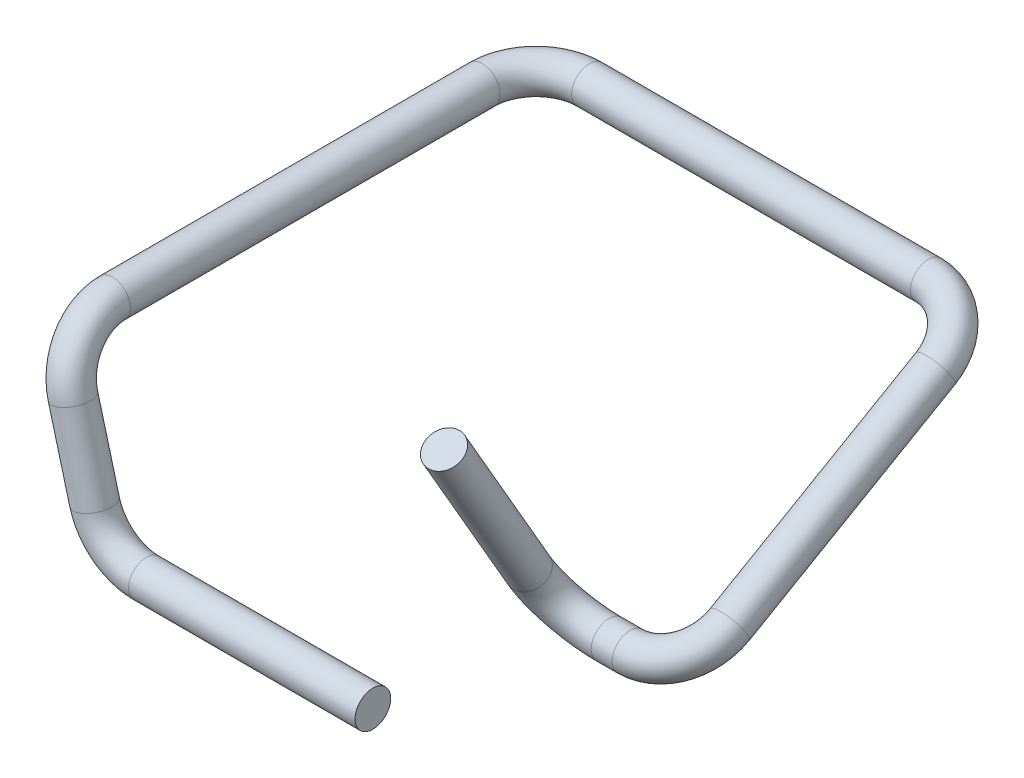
from build123d import *

# Parameters (mm, degrees)
SKETCH1_R = 10


with BuildPart() as part:
    # Sweep1: sweep along a curve in space
    with BuildLine() as sweep1_path:
        Line((0, 0, 0), (-126.980190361, 0, 0))
        ThreePointArc((-126.980190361, 0, 0), (-145.243033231, 6.199399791, 0), (-155.957965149, 22.235428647, 0))
        Line((-155.957965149, 22.235428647, 0), (-168.117333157, 67.61480784, 0))
        ThreePointArc((-168.117333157, 67.61480784, 0), (-173.607714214, 88.105188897, -8.786796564), (-175.88190451, 96.592582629, -30))
        Line((-175.88190451, 96.592582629, -30), (-175.88190451, 96.592582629, -237.303260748))
        ThreePointArc((-175.88190451, 96.592582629, -237.303260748), (-167.095107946, 96.592582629, -258.516464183), (-145.88190451, 96.592582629, -267.303260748))
        Line((-145.88190451, 96.592582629, -267.303260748), (44.11809549, 96.592582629, -267.303260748))
        ThreePointArc((44.11809549, 96.592582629, -267.303260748), (65.331298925, 92.199184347, -259.693671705), (74.11809549, 81.592582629, -241.322498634))
        Line((74.11809549, 81.592582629, -241.322498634), (74.11809549, 15, -125.980762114))
        ThreePointArc((74.11809549, 15, -125.980762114), (65.331298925, 4.393398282, -107.609589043), (44.11809549, 0, -100))
        Line((44.11809549, 0, -100), (32.397602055, 0, -100))
        ThreePointArc((32.397602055, 0, -100), (11.184398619, 7.609589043, -95.606601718), (2.397602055, 25.980762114, -85))
        Line((2.397602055, 25.980762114, -85), (2.397602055, 108.253175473, -37.5))
    # Sketch1 → Sweep1 (sweep)
    with BuildSketch(Plane(origin=(0, 0, 0), x_dir=(0, 0, -1), z_dir=(1, 0, 0))):
        Circle(SKETCH1_R)
    sweep(path=sweep1_path.line)


solid = part.part
